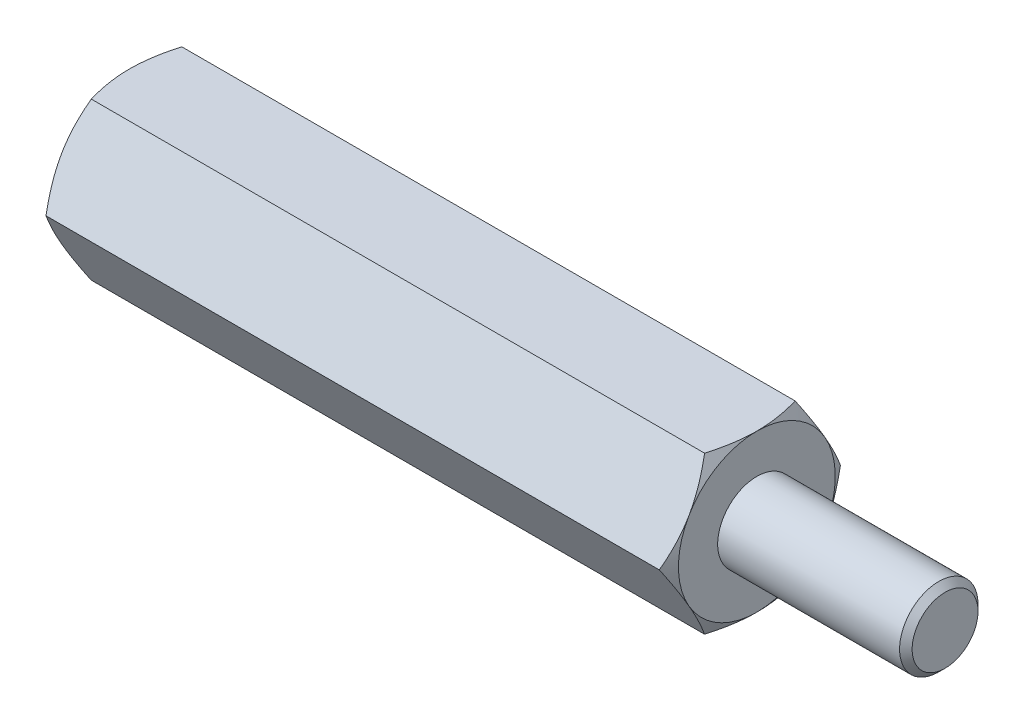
ISO-10303-21;
HEADER;
FILE_DESCRIPTION(('STEP AP214'),'2;1');
FILE_NAME('part.step','',(''),(''),'','','');
FILE_SCHEMA(('AUTOMOTIVE_DESIGN { 1 0 10303 214 1 1 1 1 }'));
ENDSEC;
DATA;
#1=APPLICATION_CONTEXT('core data for automotive mechanical design processes');
#2=APPLICATION_PROTOCOL_DEFINITION('international standard','automotive_design',2000,#1);
#3=PRODUCT_CONTEXT('',#1,'mechanical');
#4=PRODUCT('Part','Part','',(#3));
#5=PRODUCT_RELATED_PRODUCT_CATEGORY('part','',(#4));
#6=PRODUCT_DEFINITION_FORMATION('','',#4);
#7=PRODUCT_DEFINITION_CONTEXT('part definition',#1,'design');
#8=PRODUCT_DEFINITION('design','',#6,#7);
#9=PRODUCT_DEFINITION_SHAPE('','',#8);
#10=(LENGTH_UNIT() NAMED_UNIT(*) SI_UNIT(.MILLI.,.METRE.));
#11=(NAMED_UNIT(*) PLANE_ANGLE_UNIT() SI_UNIT($,.RADIAN.));
#12=(NAMED_UNIT(*) SI_UNIT($,.STERADIAN.) SOLID_ANGLE_UNIT());
#13=UNCERTAINTY_MEASURE_WITH_UNIT(LENGTH_MEASURE(1.E-05),#10,'distance_accuracy_value','');
#14=(GEOMETRIC_REPRESENTATION_CONTEXT(3) GLOBAL_UNCERTAINTY_ASSIGNED_CONTEXT((#13)) GLOBAL_UNIT_ASSIGNED_CONTEXT((#10,
#11,#12)) REPRESENTATION_CONTEXT('',''));
#15=CARTESIAN_POINT('',(0.,0.,0.));
#16=DIRECTION('',(0.,0.,1.));
#17=DIRECTION('',(1.,0.,0.));
#18=AXIS2_PLACEMENT_3D('',#15,#16,#17);
#19=CARTESIAN_POINT('',(10.,2.5,-1.44337567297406));
#20=DIRECTION('',(1.,0.,0.));
#21=DIRECTION('',(0.,0.,-1.));
#22=AXIS2_PLACEMENT_3D('',#19,#20,#21);
#23=PLANE('',#22);
#24=CARTESIAN_POINT('',(10.,0.,0.));
#25=DIRECTION('',(1.,0.,0.));
#26=DIRECTION('',(0.,0.,-1.));
#27=AXIS2_PLACEMENT_3D('',#24,#25,#26);
#28=CIRCLE('',#27,2.5);
#29=CARTESIAN_POINT('',(10.,-1.25,-2.1650635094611));
#30=VERTEX_POINT('',#29);
#31=CARTESIAN_POINT('',(10.,1.25,-2.1650635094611));
#32=VERTEX_POINT('',#31);
#33=EDGE_CURVE('E288',#30,#32,#28,.T.);
#34=ORIENTED_EDGE('',*,*,#33,.T.);
#35=CARTESIAN_POINT('',(10.,2.5,0.));
#36=VERTEX_POINT('',#35);
#37=EDGE_CURVE('E53',#32,#36,#28,.T.);
#38=ORIENTED_EDGE('',*,*,#37,.T.);
#39=CARTESIAN_POINT('',(10.,1.25,2.1650635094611));
#40=VERTEX_POINT('',#39);
#41=EDGE_CURVE('E296',#36,#40,#28,.T.);
#42=ORIENTED_EDGE('',*,*,#41,.T.);
#43=CARTESIAN_POINT('',(10.,-1.25,2.1650635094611));
#44=VERTEX_POINT('',#43);
#45=EDGE_CURVE('E302',#40,#44,#28,.T.);
#46=ORIENTED_EDGE('',*,*,#45,.T.);
#47=CARTESIAN_POINT('',(10.,0.,0.));
#48=DIRECTION('',(-1.,0.,0.));
#49=DIRECTION('',(0.,-1.,0.));
#50=AXIS2_PLACEMENT_3D('',#47,#48,#49);
#51=CIRCLE('',#50,2.5);
#52=CARTESIAN_POINT('',(10.,-2.5,0.));
#53=VERTEX_POINT('',#52);
#54=EDGE_CURVE('E193',#53,#44,#51,.T.);
#55=ORIENTED_EDGE('',*,*,#54,.F.);
#56=EDGE_CURVE('E61',#53,#30,#28,.T.);
#57=ORIENTED_EDGE('',*,*,#56,.T.);
#58=EDGE_LOOP('',(#34,#38,#42,#46,#55,#57));
#59=FACE_BOUND('',#58,.T.);
#60=CARTESIAN_POINT('',(10.,0.,0.));
#61=DIRECTION('',(1.,0.,0.));
#62=DIRECTION('',(0.,0.,-1.));
#63=AXIS2_PLACEMENT_3D('',#60,#61,#62);
#64=CIRCLE('',#63,1.25);
#65=CARTESIAN_POINT('',(10.,0.,-1.25));
#66=VERTEX_POINT('',#65);
#67=EDGE_CURVE('E322',#66,#66,#64,.T.);
#68=ORIENTED_EDGE('',*,*,#67,.F.);
#69=EDGE_LOOP('',(#68));
#70=FACE_BOUND('',#69,.T.);
#71=ADVANCED_FACE('F37',(#59,#70),#23,.T.);
#72=CARTESIAN_POINT('',(10.,0.,-2.88675134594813));
#73=DIRECTION('',(0.,-0.5,0.866025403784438));
#74=DIRECTION('',(0.,-0.866025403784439,-0.5));
#75=AXIS2_PLACEMENT_3D('',#72,#73,#74);
#76=PLANE('',#75);
#77=CARTESIAN_POINT('',(9.7766423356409,-0.00019999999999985,-2.88686681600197));
#78=CARTESIAN_POINT('',(9.81327837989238,0.109663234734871,-2.82343724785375));
#79=CARTESIAN_POINT('',(9.84659778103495,0.220474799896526,-2.75946016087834));
#80=CARTESIAN_POINT('',(9.90475771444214,0.444016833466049,-2.63039810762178));
#81=CARTESIAN_POINT('',(9.92957767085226,0.556751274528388,-2.5653108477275));
#82=CARTESIAN_POINT('',(9.96821434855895,0.780822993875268,-2.43594298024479));
#83=CARTESIAN_POINT('',(9.98228820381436,0.892125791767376,-2.37168227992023));
#84=CARTESIAN_POINT('',(9.99909084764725,1.11525522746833,-2.24285844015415));
#85=CARTESIAN_POINT('',(10.0018335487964,1.22708105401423,-2.17829576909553));
#86=CARTESIAN_POINT('',(9.99613423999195,1.43604197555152,-2.05765212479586));
#87=CARTESIAN_POINT('',(9.98909160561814,1.53320831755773,-2.0015531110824));
#88=CARTESIAN_POINT('',(9.96676858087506,1.726907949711,-1.88972057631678));
#89=CARTESIAN_POINT('',(9.95148056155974,1.82344056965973,-1.8339874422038));
#90=CARTESIAN_POINT('',(9.91326090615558,2.01753972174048,-1.7219242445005));
#91=CARTESIAN_POINT('',(9.89016722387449,2.11508168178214,-1.66560836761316));
#92=CARTESIAN_POINT('',(9.83775334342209,2.30871060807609,-1.55381665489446));
#93=CARTESIAN_POINT('',(9.80844546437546,2.40480005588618,-1.49833938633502));
#94=CARTESIAN_POINT('',(9.7766423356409,2.5002,-1.44326020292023));
#95=B_SPLINE_CURVE_WITH_KNOTS('',3,(#77,#78,#79,#80,#81,#82,#83,#84,#85,#86,#87,#88,#89,#90,#91,
#92,#93,#94),.UNSPECIFIED.,.F.,.F.,(4,2,2,2,2,2,2,2,4),(0.,0.396285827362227,0.79352433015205,
1.18093086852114,1.56786160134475,1.90479741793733,2.24204551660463,2.58677531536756,
2.93082800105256),.UNSPECIFIED.);
#96=CARTESIAN_POINT('',(9.7767090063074,0.,-2.88675134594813));
#97=VERTEX_POINT('',#96);
#98=EDGE_CURVE('E350',#97,#32,#95,.T.);
#99=ORIENTED_EDGE('',*,*,#98,.F.);
#100=DIRECTION('',(-1.,0.,0.));
#101=VECTOR('',#100,1.);
#102=CARTESIAN_POINT('',(10.,0.,-2.88675134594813));
#103=LINE('',#102,#101);
#104=CARTESIAN_POINT('',(-9.7767090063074,0.,-2.88675134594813));
#105=VERTEX_POINT('',#104);
#106=EDGE_CURVE('E264',#97,#105,#103,.T.);
#107=ORIENTED_EDGE('',*,*,#106,.T.);
#108=CARTESIAN_POINT('',(-9.7766423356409,2.5002,-1.44326020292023));
#109=CARTESIAN_POINT('',(-9.81327837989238,2.39033676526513,-1.50668977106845));
#110=CARTESIAN_POINT('',(-9.84659778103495,2.27952520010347,-1.57066685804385));
#111=CARTESIAN_POINT('',(-9.90475771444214,2.05598316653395,-1.69972891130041));
#112=CARTESIAN_POINT('',(-9.92957767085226,1.94324872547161,-1.7648161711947));
#113=CARTESIAN_POINT('',(-9.96821434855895,1.71917700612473,-1.8941840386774));
#114=CARTESIAN_POINT('',(-9.98228820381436,1.60787420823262,-1.95844473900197));
#115=CARTESIAN_POINT('',(-9.99909084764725,1.38474477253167,-2.08726857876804));
#116=CARTESIAN_POINT('',(-10.0018335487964,1.27291894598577,-2.15183124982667));
#117=CARTESIAN_POINT('',(-9.99613423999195,1.06395802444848,-2.27247489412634));
#118=CARTESIAN_POINT('',(-9.98909160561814,0.96679168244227,-2.32857390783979));
#119=CARTESIAN_POINT('',(-9.96676858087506,0.773092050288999,-2.44040644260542));
#120=CARTESIAN_POINT('',(-9.95148056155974,0.676559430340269,-2.49613957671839));
#121=CARTESIAN_POINT('',(-9.91326090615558,0.482460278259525,-2.60820277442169));
#122=CARTESIAN_POINT('',(-9.89016722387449,0.38491831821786,-2.66451865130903));
#123=CARTESIAN_POINT('',(-9.83775334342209,0.191289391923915,-2.77631036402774));
#124=CARTESIAN_POINT('',(-9.80844546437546,0.0951999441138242,-2.83178763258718));
#125=CARTESIAN_POINT('',(-9.7766423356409,-0.000199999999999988,-2.88686681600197));
#126=B_SPLINE_CURVE_WITH_KNOTS('',3,(#108,#109,#110,#111,#112,#113,#114,#115,#116,#117,#118,
#119,#120,#121,#122,#123,#124,#125),.UNSPECIFIED.,.F.,.F.,(4,2,2,2,2,2,2,2,4),(0.,
0.396285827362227,0.79352433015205,1.18093086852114,1.56786160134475,1.90479741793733,
2.24204551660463,2.58677531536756,2.93082800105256),.UNSPECIFIED.);
#127=CARTESIAN_POINT('',(-10.,1.25,-2.1650635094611));
#128=VERTEX_POINT('',#127);
#129=EDGE_CURVE('E340',#128,#105,#126,.T.);
#130=ORIENTED_EDGE('',*,*,#129,.F.);
#131=CARTESIAN_POINT('',(-9.7767090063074,2.5,-1.44337567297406));
#132=VERTEX_POINT('',#131);
#133=EDGE_CURVE('E405',#132,#128,#126,.T.);
#134=ORIENTED_EDGE('',*,*,#133,.F.);
#135=DIRECTION('',(-1.,0.,0.));
#136=VECTOR('',#135,1.);
#137=CARTESIAN_POINT('',(10.,2.5,-1.44337567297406));
#138=LINE('',#137,#136);
#139=CARTESIAN_POINT('',(9.77670900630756,2.5,-1.44337567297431));
#140=VERTEX_POINT('',#139);
#141=EDGE_CURVE('E279',#140,#132,#138,.T.);
#142=ORIENTED_EDGE('',*,*,#141,.F.);
#143=EDGE_CURVE('E229',#32,#140,#95,.T.);
#144=ORIENTED_EDGE('',*,*,#143,.F.);
#145=EDGE_LOOP('',(#99,#107,#130,#134,#142,#144));
#146=FACE_BOUND('',#145,.T.);
#147=ADVANCED_FACE('F148',(#146),#76,.F.);
#148=CARTESIAN_POINT('',(10.,2.5,-1.44337567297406));
#149=DIRECTION('',(0.,-1.,0.));
#150=DIRECTION('',(0.,0.,-1.));
#151=AXIS2_PLACEMENT_3D('',#148,#149,#150);
#152=PLANE('',#151);
#153=CARTESIAN_POINT('',(8.76803388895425,2.5,-3.90158441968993));
#154=CARTESIAN_POINT('',(8.82120772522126,2.5,-3.79217004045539));
#155=CARTESIAN_POINT('',(8.87387869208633,2.5,-3.68250707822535));
#156=CARTESIAN_POINT('',(8.97793249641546,2.5,-3.46255185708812));
#157=CARTESIAN_POINT('',(9.02931513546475,2.5,-3.35225950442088));
#158=CARTESIAN_POINT('',(9.13076309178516,2.5,-3.130356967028));
#159=CARTESIAN_POINT('',(9.18081992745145,2.5,-3.01874289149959));
#160=CARTESIAN_POINT('',(9.27891712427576,2.5,-2.79463535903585));
#161=CARTESIAN_POINT('',(9.32695757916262,2.5,-2.68214194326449));
#162=CARTESIAN_POINT('',(9.42201845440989,2.5,-2.45240385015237));
#163=CARTESIAN_POINT('',(9.46895431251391,2.5,-2.33512399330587));
#164=CARTESIAN_POINT('',(9.55933269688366,2.5,-2.09920133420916));
#165=CARTESIAN_POINT('',(9.60277483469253,2.5,-1.98055838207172));
#166=CARTESIAN_POINT('',(9.68504351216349,2.5,-1.74193489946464));
#167=CARTESIAN_POINT('',(9.72387917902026,2.5,-1.6219575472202));
#168=CARTESIAN_POINT('',(9.79570507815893,2.5,-1.38028205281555));
#169=CARTESIAN_POINT('',(9.82869712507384,2.5,-1.25858445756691));
#170=CARTESIAN_POINT('',(9.88709594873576,2.5,-1.01406369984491));
#171=CARTESIAN_POINT('',(9.91254379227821,2.5,-0.89125052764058));
#172=CARTESIAN_POINT('',(9.95442751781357,2.5,-0.644071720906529));
#173=CARTESIAN_POINT('',(9.97086432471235,2.5,-0.519706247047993));
#174=CARTESIAN_POINT('',(9.9932006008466,2.5,-0.271679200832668));
#175=CARTESIAN_POINT('',(9.99923751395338,2.5,-0.148030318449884));
#176=CARTESIAN_POINT('',(10.0006256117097,2.5,0.0993395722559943));
#177=CARTESIAN_POINT('',(9.99597656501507,2.5,0.223060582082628));
#178=CARTESIAN_POINT('',(9.97940443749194,2.5,0.432351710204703));
#179=CARTESIAN_POINT('',(9.97010665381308,2.5,0.518143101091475));
#180=CARTESIAN_POINT('',(9.94693847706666,2.5,0.689112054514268));
#181=CARTESIAN_POINT('',(9.93306748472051,2.5,0.77428953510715));
#182=CARTESIAN_POINT('',(9.88532020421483,2.5,1.02876599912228));
#183=CARTESIAN_POINT('',(9.84531764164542,2.5,1.19691958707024));
#184=CARTESIAN_POINT('',(9.75226567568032,2.5,1.53362893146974));
#185=CARTESIAN_POINT('',(9.69893620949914,2.5,1.70210423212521));
#186=CARTESIAN_POINT('',(9.61237169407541,2.5,1.95247339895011));
#187=CARTESIAN_POINT('',(9.58242477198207,2.5,2.03553184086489));
#188=CARTESIAN_POINT('',(9.52068409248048,2.5,2.20095860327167));
#189=CARTESIAN_POINT('',(9.48889037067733,2.5,2.2833269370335));
#190=CARTESIAN_POINT('',(9.40401426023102,2.5,2.49723312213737));
#191=CARTESIAN_POINT('',(9.34971733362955,2.5,2.6282879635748));
#192=CARTESIAN_POINT('',(9.2381273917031,2.5,2.88912034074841));
#193=CARTESIAN_POINT('',(9.1808341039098,2.5,3.01889775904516));
#194=CARTESIAN_POINT('',(9.06393487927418,2.5,3.27745045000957));
#195=CARTESIAN_POINT('',(9.00432825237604,2.5,3.40622540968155));
#196=CARTESIAN_POINT('',(8.8833234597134,2.5,3.66293235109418));
#197=CARTESIAN_POINT('',(8.82192524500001,2.5,3.79086430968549));
#198=CARTESIAN_POINT('',(8.63545801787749,2.5,4.17399495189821));
#199=CARTESIAN_POINT('',(8.50828249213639,2.5,4.42816724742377));
#200=CARTESIAN_POINT('',(8.25034557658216,2.5,4.93461464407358));
#201=CARTESIAN_POINT('',(8.11958483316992,2.5,5.18689007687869));
#202=CARTESIAN_POINT('',(7.86871001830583,2.5,5.66512451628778));
#203=CARTESIAN_POINT('',(7.74882986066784,2.5,5.89120644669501));
#204=CARTESIAN_POINT('',(7.50759021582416,2.5,6.34259369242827));
#205=CARTESIAN_POINT('',(7.38623065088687,2.5,6.56789896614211));
#206=CARTESIAN_POINT('',(7.14278038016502,2.5,7.01722044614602));
#207=CARTESIAN_POINT('',(7.02069305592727,2.5,7.24123848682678));
#208=CARTESIAN_POINT('',(6.77566624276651,2.5,7.68878772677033));
#209=CARTESIAN_POINT('',(6.65272681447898,2.5,7.9123189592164));
#210=CARTESIAN_POINT('',(6.52947566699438,2.5,8.13567697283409));
#211=B_SPLINE_CURVE_WITH_KNOTS('',3,(#153,#154,#155,#156,#157,#158,#159,#160,#161,#162,#163,
#164,#165,#166,#167,#168,#169,#170,#171,#172,#173,#174,#175,#176,#177,#178,#179,#180,#181,#182,
#183,#184,#185,#186,#187,#188,#189,#190,#191,#192,#193,#194,#195,#196,#197,#198,#199,#200,#201,
#202,#203,#204,#205,#206,#207,#208,#209,#210),.UNSPECIFIED.,.F.,.F.,(4,2,2,2,2,2,2,2,2,2,2,2,2,
2,2,2,2,2,2,2,2,2,2,2,2,2,2,2,4),(0.,0.364957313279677,0.729970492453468,1.09692930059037,
1.46387103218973,1.84279746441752,2.22176597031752,2.59997058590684,2.97805755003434,
3.35404692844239,3.72999770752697,4.10094071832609,4.47189175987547,4.73064905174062,
4.98944026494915,5.5072907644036,6.03710483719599,6.30196454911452,6.56681915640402,
6.99233818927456,7.41789598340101,7.84358170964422,8.26927907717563,9.12186602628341,
9.97430025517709,10.7419897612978,11.5097197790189,12.2750964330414,13.0404191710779),.UNSPECIFIED.);
#212=EDGE_CURVE('E227',#140,#36,#211,.T.);
#213=ORIENTED_EDGE('',*,*,#212,.F.);
#214=ORIENTED_EDGE('',*,*,#141,.T.);
#215=CARTESIAN_POINT('',(-8.76803388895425,2.5,-3.90158441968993));
#216=CARTESIAN_POINT('',(-8.82120772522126,2.5,-3.79217004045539));
#217=CARTESIAN_POINT('',(-8.87387869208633,2.5,-3.68250707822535));
#218=CARTESIAN_POINT('',(-8.97793249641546,2.5,-3.46255185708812));
#219=CARTESIAN_POINT('',(-9.02931513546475,2.5,-3.35225950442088));
#220=CARTESIAN_POINT('',(-9.13076309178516,2.5,-3.130356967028));
#221=CARTESIAN_POINT('',(-9.18081992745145,2.5,-3.01874289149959));
#222=CARTESIAN_POINT('',(-9.27891712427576,2.5,-2.79463535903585));
#223=CARTESIAN_POINT('',(-9.32695757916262,2.5,-2.68214194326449));
#224=CARTESIAN_POINT('',(-9.42201845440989,2.5,-2.45240385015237));
#225=CARTESIAN_POINT('',(-9.46895431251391,2.5,-2.33512399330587));
#226=CARTESIAN_POINT('',(-9.55933269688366,2.5,-2.09920133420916));
#227=CARTESIAN_POINT('',(-9.60277483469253,2.5,-1.98055838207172));
#228=CARTESIAN_POINT('',(-9.68504351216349,2.5,-1.74193489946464));
#229=CARTESIAN_POINT('',(-9.72387917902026,2.5,-1.6219575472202));
#230=CARTESIAN_POINT('',(-9.79570507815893,2.5,-1.38028205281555));
#231=CARTESIAN_POINT('',(-9.82869712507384,2.5,-1.25858445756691));
#232=CARTESIAN_POINT('',(-9.88709594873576,2.5,-1.01406369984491));
#233=CARTESIAN_POINT('',(-9.91254379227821,2.5,-0.89125052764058));
#234=CARTESIAN_POINT('',(-9.95442751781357,2.5,-0.644071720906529));
#235=CARTESIAN_POINT('',(-9.97086432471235,2.5,-0.519706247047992));
#236=CARTESIAN_POINT('',(-9.9932006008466,2.5,-0.271679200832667));
#237=CARTESIAN_POINT('',(-9.99923751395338,2.5,-0.148030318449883));
#238=CARTESIAN_POINT('',(-10.0006256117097,2.5,0.0993395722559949));
#239=CARTESIAN_POINT('',(-9.99597656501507,2.5,0.223060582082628));
#240=CARTESIAN_POINT('',(-9.97940443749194,2.5,0.432351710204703));
#241=CARTESIAN_POINT('',(-9.97010665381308,2.5,0.518143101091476));
#242=CARTESIAN_POINT('',(-9.94693847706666,2.5,0.689112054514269));
#243=CARTESIAN_POINT('',(-9.93306748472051,2.5,0.774289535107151));
#244=CARTESIAN_POINT('',(-9.88532020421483,2.5,1.02876599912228));
#245=CARTESIAN_POINT('',(-9.84531764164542,2.5,1.19691958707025));
#246=CARTESIAN_POINT('',(-9.75226567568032,2.5,1.53362893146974));
#247=CARTESIAN_POINT('',(-9.69893620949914,2.5,1.70210423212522));
#248=CARTESIAN_POINT('',(-9.61237169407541,2.5,1.95247339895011));
#249=CARTESIAN_POINT('',(-9.58242477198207,2.5,2.03553184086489));
#250=CARTESIAN_POINT('',(-9.52068409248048,2.5,2.20095860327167));
#251=CARTESIAN_POINT('',(-9.48889037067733,2.5,2.2833269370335));
#252=CARTESIAN_POINT('',(-9.40401426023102,2.5,2.49723312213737));
#253=CARTESIAN_POINT('',(-9.34971733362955,2.5,2.6282879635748));
#254=CARTESIAN_POINT('',(-9.2381273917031,2.5,2.88912034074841));
#255=CARTESIAN_POINT('',(-9.1808341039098,2.5,3.01889775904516));
#256=CARTESIAN_POINT('',(-9.06393487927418,2.5,3.27745045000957));
#257=CARTESIAN_POINT('',(-9.00432825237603,2.5,3.40622540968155));
#258=CARTESIAN_POINT('',(-8.8833234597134,2.5,3.66293235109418));
#259=CARTESIAN_POINT('',(-8.82192524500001,2.5,3.79086430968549));
#260=CARTESIAN_POINT('',(-8.6354580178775,2.5,4.17399495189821));
#261=CARTESIAN_POINT('',(-8.50828249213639,2.5,4.42816724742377));
#262=CARTESIAN_POINT('',(-8.25034557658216,2.5,4.93461464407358));
#263=CARTESIAN_POINT('',(-8.11958483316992,2.5,5.18689007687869));
#264=CARTESIAN_POINT('',(-7.86871001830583,2.5,5.66512451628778));
#265=CARTESIAN_POINT('',(-7.74882986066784,2.5,5.89120644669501));
#266=CARTESIAN_POINT('',(-7.50759021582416,2.5,6.34259369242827));
#267=CARTESIAN_POINT('',(-7.38623065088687,2.5,6.56789896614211));
#268=CARTESIAN_POINT('',(-7.14278038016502,2.5,7.01722044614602));
#269=CARTESIAN_POINT('',(-7.02069305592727,2.5,7.24123848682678));
#270=CARTESIAN_POINT('',(-6.77566624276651,2.5,7.68878772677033));
#271=CARTESIAN_POINT('',(-6.65272681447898,2.5,7.9123189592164));
#272=CARTESIAN_POINT('',(-6.52947566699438,2.5,8.13567697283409));
#273=B_SPLINE_CURVE_WITH_KNOTS('',3,(#215,#216,#217,#218,#219,#220,#221,#222,#223,#224,#225,
#226,#227,#228,#229,#230,#231,#232,#233,#234,#235,#236,#237,#238,#239,#240,#241,#242,#243,#244,
#245,#246,#247,#248,#249,#250,#251,#252,#253,#254,#255,#256,#257,#258,#259,#260,#261,#262,#263,
#264,#265,#266,#267,#268,#269,#270,#271,#272),.UNSPECIFIED.,.F.,.F.,(4,2,2,2,2,2,2,2,2,2,2,2,2,
2,2,2,2,2,2,2,2,2,2,2,2,2,2,2,4),(0.,0.364957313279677,0.729970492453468,1.09692930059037,
1.46387103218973,1.84279746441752,2.22176597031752,2.59997058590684,2.97805755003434,
3.35404692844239,3.72999770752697,4.10094071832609,4.47189175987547,4.73064905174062,
4.98944026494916,5.5072907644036,6.03710483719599,6.30196454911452,6.56681915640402,
6.99233818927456,7.41789598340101,7.84358170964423,8.26927907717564,9.12186602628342,
9.9743002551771,10.7419897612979,11.5097197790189,12.2750964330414,13.0404191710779),.UNSPECIFIED.);
#274=CARTESIAN_POINT('',(-10.,2.5,0.));
#275=VERTEX_POINT('',#274);
#276=EDGE_CURVE('E241',#275,#132,#273,.F.);
#277=ORIENTED_EDGE('',*,*,#276,.F.);
#278=CARTESIAN_POINT('',(-9.7767090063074,2.5,1.44337567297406));
#279=VERTEX_POINT('',#278);
#280=EDGE_CURVE('E249',#279,#275,#273,.F.);
#281=ORIENTED_EDGE('',*,*,#280,.F.);
#282=DIRECTION('',(-1.,0.,0.));
#283=VECTOR('',#282,1.);
#284=CARTESIAN_POINT('',(10.,2.5,1.44337567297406));
#285=LINE('',#284,#283);
#286=CARTESIAN_POINT('',(9.7767090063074,2.5,1.44337567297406));
#287=VERTEX_POINT('',#286);
#288=EDGE_CURVE('E276',#287,#279,#285,.T.);
#289=ORIENTED_EDGE('',*,*,#288,.F.);
#290=EDGE_CURVE('E221',#36,#287,#211,.T.);
#291=ORIENTED_EDGE('',*,*,#290,.F.);
#292=EDGE_LOOP('',(#213,#214,#277,#281,#289,#291));
#293=FACE_BOUND('',#292,.T.);
#294=ADVANCED_FACE('F153',(#293),#152,.F.);
#295=CARTESIAN_POINT('',(10.,2.5,1.44337567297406));
#296=DIRECTION('',(0.,-0.5,-0.866025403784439));
#297=DIRECTION('',(0.,0.866025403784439,-0.5));
#298=AXIS2_PLACEMENT_3D('',#295,#296,#297);
#299=PLANE('',#298);
#300=CARTESIAN_POINT('',(9.7766423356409,2.5002,1.44326020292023));
#301=CARTESIAN_POINT('',(9.81327837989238,2.39033676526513,1.50668977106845));
#302=CARTESIAN_POINT('',(9.84659778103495,2.27952520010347,1.57066685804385));
#303=CARTESIAN_POINT('',(9.90475771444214,2.05598316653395,1.69972891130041));
#304=CARTESIAN_POINT('',(9.92957767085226,1.94324872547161,1.7648161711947));
#305=CARTESIAN_POINT('',(9.96821434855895,1.71917700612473,1.8941840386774));
#306=CARTESIAN_POINT('',(9.98228820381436,1.60787420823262,1.95844473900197));
#307=CARTESIAN_POINT('',(9.99909084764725,1.38474477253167,2.08726857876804));
#308=CARTESIAN_POINT('',(10.0018335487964,1.27291894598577,2.15183124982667));
#309=CARTESIAN_POINT('',(9.99613423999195,1.06395802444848,2.27247489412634));
#310=CARTESIAN_POINT('',(9.98909160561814,0.96679168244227,2.32857390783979));
#311=CARTESIAN_POINT('',(9.96676858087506,0.773092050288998,2.44040644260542));
#312=CARTESIAN_POINT('',(9.95148056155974,0.676559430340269,2.49613957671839));
#313=CARTESIAN_POINT('',(9.91326090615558,0.482460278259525,2.60820277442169));
#314=CARTESIAN_POINT('',(9.89016722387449,0.38491831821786,2.66451865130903));
#315=CARTESIAN_POINT('',(9.83775334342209,0.191289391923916,2.77631036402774));
#316=CARTESIAN_POINT('',(9.80844546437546,0.0951999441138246,2.83178763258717));
#317=CARTESIAN_POINT('',(9.7766423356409,-0.000199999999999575,2.88686681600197));
#318=B_SPLINE_CURVE_WITH_KNOTS('',3,(#300,#301,#302,#303,#304,#305,#306,#307,#308,#309,#310,
#311,#312,#313,#314,#315,#316,#317),.UNSPECIFIED.,.F.,.F.,(4,2,2,2,2,2,2,2,4),(0.,
0.396285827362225,0.79352433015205,1.18093086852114,1.56786160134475,1.90479741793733,
2.24204551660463,2.58677531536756,2.93082800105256),.UNSPECIFIED.);
#319=EDGE_CURVE('E228',#287,#40,#318,.T.);
#320=ORIENTED_EDGE('',*,*,#319,.F.);
#321=ORIENTED_EDGE('',*,*,#288,.T.);
#322=CARTESIAN_POINT('',(-9.7766423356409,-0.000199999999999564,2.88686681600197));
#323=CARTESIAN_POINT('',(-9.81327837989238,0.109663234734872,2.82343724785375));
#324=CARTESIAN_POINT('',(-9.84659778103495,0.220474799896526,2.75946016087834));
#325=CARTESIAN_POINT('',(-9.90475771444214,0.444016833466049,2.63039810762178));
#326=CARTESIAN_POINT('',(-9.92957767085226,0.556751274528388,2.5653108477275));
#327=CARTESIAN_POINT('',(-9.96821434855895,0.780822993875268,2.43594298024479));
#328=CARTESIAN_POINT('',(-9.98228820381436,0.892125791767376,2.37168227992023));
#329=CARTESIAN_POINT('',(-9.99909084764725,1.11525522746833,2.24285844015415));
#330=CARTESIAN_POINT('',(-10.0018335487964,1.22708105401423,2.17829576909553));
#331=CARTESIAN_POINT('',(-9.99613423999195,1.43604197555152,2.05765212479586));
#332=CARTESIAN_POINT('',(-9.98909160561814,1.53320831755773,2.0015531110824));
#333=CARTESIAN_POINT('',(-9.96676858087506,1.726907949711,1.88972057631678));
#334=CARTESIAN_POINT('',(-9.95148056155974,1.82344056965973,1.8339874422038));
#335=CARTESIAN_POINT('',(-9.91326090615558,2.01753972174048,1.7219242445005));
#336=CARTESIAN_POINT('',(-9.89016722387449,2.11508168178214,1.66560836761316));
#337=CARTESIAN_POINT('',(-9.83775334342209,2.30871060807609,1.55381665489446));
#338=CARTESIAN_POINT('',(-9.80844546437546,2.40480005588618,1.49833938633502));
#339=CARTESIAN_POINT('',(-9.7766423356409,2.5002,1.44326020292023));
#340=B_SPLINE_CURVE_WITH_KNOTS('',3,(#322,#323,#324,#325,#326,#327,#328,#329,#330,#331,#332,
#333,#334,#335,#336,#337,#338,#339),.UNSPECIFIED.,.F.,.F.,(4,2,2,2,2,2,2,2,4),(0.,
0.396285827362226,0.793524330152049,1.18093086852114,1.56786160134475,1.90479741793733,
2.24204551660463,2.58677531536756,2.93082800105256),.UNSPECIFIED.);
#341=CARTESIAN_POINT('',(-10.,1.25,2.1650635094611));
#342=VERTEX_POINT('',#341);
#343=EDGE_CURVE('E255',#342,#279,#340,.T.);
#344=ORIENTED_EDGE('',*,*,#343,.F.);
#345=CARTESIAN_POINT('',(-9.7767090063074,0.,2.88675134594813));
#346=VERTEX_POINT('',#345);
#347=EDGE_CURVE('E262',#346,#342,#340,.T.);
#348=ORIENTED_EDGE('',*,*,#347,.F.);
#349=DIRECTION('',(-1.,0.,0.));
#350=VECTOR('',#349,1.);
#351=CARTESIAN_POINT('',(10.,0.,2.88675134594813));
#352=LINE('',#351,#350);
#353=CARTESIAN_POINT('',(9.7767090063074,0.,2.88675134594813));
#354=VERTEX_POINT('',#353);
#355=EDGE_CURVE('E273',#354,#346,#352,.T.);
#356=ORIENTED_EDGE('',*,*,#355,.F.);
#357=EDGE_CURVE('E215',#40,#354,#318,.T.);
#358=ORIENTED_EDGE('',*,*,#357,.F.);
#359=EDGE_LOOP('',(#320,#321,#344,#348,#356,#358));
#360=FACE_BOUND('',#359,.T.);
#361=ADVANCED_FACE('F235',(#360),#299,.F.);
#362=CARTESIAN_POINT('',(10.,0.,2.88675134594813));
#363=DIRECTION('',(0.,0.5,-0.866025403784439));
#364=DIRECTION('',(0.,0.866025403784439,0.5));
#365=AXIS2_PLACEMENT_3D('',#362,#363,#364);
#366=PLANE('',#365);
#367=CARTESIAN_POINT('',(9.7766423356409,0.000200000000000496,2.88686681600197));
#368=CARTESIAN_POINT('',(9.81327837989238,-0.10966323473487,2.82343724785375));
#369=CARTESIAN_POINT('',(9.84659778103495,-0.220474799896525,2.75946016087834));
#370=CARTESIAN_POINT('',(9.90475771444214,-0.444016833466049,2.63039810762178));
#371=CARTESIAN_POINT('',(9.92957767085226,-0.556751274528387,2.5653108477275));
#372=CARTESIAN_POINT('',(9.96821434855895,-0.780822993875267,2.43594298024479));
#373=CARTESIAN_POINT('',(9.98228820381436,-0.892125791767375,2.37168227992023));
#374=CARTESIAN_POINT('',(9.99909084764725,-1.11525522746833,2.24285844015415));
#375=CARTESIAN_POINT('',(10.0018335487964,-1.22708105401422,2.17829576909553));
#376=CARTESIAN_POINT('',(9.99613423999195,-1.43604197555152,2.05765212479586));
#377=CARTESIAN_POINT('',(9.98909160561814,-1.53320831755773,2.0015531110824));
#378=CARTESIAN_POINT('',(9.96676858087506,-1.726907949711,1.88972057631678));
#379=CARTESIAN_POINT('',(9.95148056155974,-1.82344056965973,1.8339874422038));
#380=CARTESIAN_POINT('',(9.91326090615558,-2.01753972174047,1.7219242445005));
#381=CARTESIAN_POINT('',(9.89016722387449,-2.11508168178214,1.66560836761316));
#382=CARTESIAN_POINT('',(9.83775334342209,-2.30871060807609,1.55381665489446));
#383=CARTESIAN_POINT('',(9.80844546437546,-2.40480005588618,1.49833938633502));
#384=CARTESIAN_POINT('',(9.7766423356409,-2.5002,1.44326020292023));
#385=B_SPLINE_CURVE_WITH_KNOTS('',3,(#367,#368,#369,#370,#371,#372,#373,#374,#375,#376,#377,
#378,#379,#380,#381,#382,#383,#384),.UNSPECIFIED.,.F.,.F.,(4,2,2,2,2,2,2,2,4),(0.,
0.396285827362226,0.79352433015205,1.18093086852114,1.56786160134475,1.90479741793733,
2.24204551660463,2.58677531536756,2.93082800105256),.UNSPECIFIED.);
#386=EDGE_CURVE('E330',#354,#44,#385,.T.);
#387=ORIENTED_EDGE('',*,*,#386,.F.);
#388=ORIENTED_EDGE('',*,*,#355,.T.);
#389=CARTESIAN_POINT('',(-9.7766423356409,-2.5002,1.44326020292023));
#390=CARTESIAN_POINT('',(-9.81327837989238,-2.39033676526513,1.50668977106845));
#391=CARTESIAN_POINT('',(-9.84659778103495,-2.27952520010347,1.57066685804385));
#392=CARTESIAN_POINT('',(-9.90475771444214,-2.05598316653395,1.69972891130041));
#393=CARTESIAN_POINT('',(-9.92957767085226,-1.94324872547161,1.7648161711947));
#394=CARTESIAN_POINT('',(-9.96821434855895,-1.71917700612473,1.8941840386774));
#395=CARTESIAN_POINT('',(-9.98228820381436,-1.60787420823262,1.95844473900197));
#396=CARTESIAN_POINT('',(-9.99909084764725,-1.38474477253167,2.08726857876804));
#397=CARTESIAN_POINT('',(-10.0018335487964,-1.27291894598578,2.15183124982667));
#398=CARTESIAN_POINT('',(-9.99613423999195,-1.06395802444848,2.27247489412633));
#399=CARTESIAN_POINT('',(-9.98909160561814,-0.966791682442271,2.32857390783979));
#400=CARTESIAN_POINT('',(-9.96676858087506,-0.773092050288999,2.44040644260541));
#401=CARTESIAN_POINT('',(-9.95148056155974,-0.676559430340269,2.49613957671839));
#402=CARTESIAN_POINT('',(-9.91326090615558,-0.482460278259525,2.60820277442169));
#403=CARTESIAN_POINT('',(-9.89016722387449,-0.38491831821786,2.66451865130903));
#404=CARTESIAN_POINT('',(-9.83775334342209,-0.191289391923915,2.77631036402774));
#405=CARTESIAN_POINT('',(-9.80844546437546,-0.0951999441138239,2.83178763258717));
#406=CARTESIAN_POINT('',(-9.7766423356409,0.000200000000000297,2.88686681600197));
#407=B_SPLINE_CURVE_WITH_KNOTS('',3,(#389,#390,#391,#392,#393,#394,#395,#396,#397,#398,#399,
#400,#401,#402,#403,#404,#405,#406),.UNSPECIFIED.,.F.,.F.,(4,2,2,2,2,2,2,2,4),(0.,
0.396285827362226,0.793524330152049,1.18093086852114,1.56786160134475,1.90479741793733,
2.24204551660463,2.58677531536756,2.93082800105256),.UNSPECIFIED.);
#408=CARTESIAN_POINT('',(-10.,-1.25,2.1650635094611));
#409=VERTEX_POINT('',#408);
#410=EDGE_CURVE('E263',#409,#346,#407,.T.);
#411=ORIENTED_EDGE('',*,*,#410,.F.);
#412=CARTESIAN_POINT('',(-9.7767090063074,-2.5,1.44337567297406));
#413=VERTEX_POINT('',#412);
#414=EDGE_CURVE('E250',#413,#409,#407,.T.);
#415=ORIENTED_EDGE('',*,*,#414,.F.);
#416=DIRECTION('',(-1.,0.,0.));
#417=VECTOR('',#416,1.);
#418=CARTESIAN_POINT('',(10.,-2.5,1.44337567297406));
#419=LINE('',#418,#417);
#420=CARTESIAN_POINT('',(9.7767090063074,-2.5,1.44337567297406));
#421=VERTEX_POINT('',#420);
#422=EDGE_CURVE('E270',#421,#413,#419,.T.);
#423=ORIENTED_EDGE('',*,*,#422,.F.);
#424=EDGE_CURVE('E210',#44,#421,#385,.T.);
#425=ORIENTED_EDGE('',*,*,#424,.F.);
#426=EDGE_LOOP('',(#387,#388,#411,#415,#423,#425));
#427=FACE_BOUND('',#426,.T.);
#428=ADVANCED_FACE('F375',(#427),#366,.F.);
#429=CARTESIAN_POINT('',(10.,-2.5,1.44337567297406));
#430=DIRECTION('',(0.,1.,0.));
#431=DIRECTION('',(0.,0.,1.));
#432=AXIS2_PLACEMENT_3D('',#429,#430,#431);
#433=PLANE('',#432);
#434=CARTESIAN_POINT('',(8.76803388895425,-2.5,-3.90158441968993));
#435=CARTESIAN_POINT('',(8.82120772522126,-2.5,-3.79217004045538));
#436=CARTESIAN_POINT('',(8.87387869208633,-2.5,-3.68250707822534));
#437=CARTESIAN_POINT('',(8.97793249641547,-2.5,-3.46255185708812));
#438=CARTESIAN_POINT('',(9.02931513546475,-2.5,-3.35225950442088));
#439=CARTESIAN_POINT('',(9.13076309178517,-2.5,-3.130356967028));
#440=CARTESIAN_POINT('',(9.18081992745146,-2.5,-3.01874289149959));
#441=CARTESIAN_POINT('',(9.27891712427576,-2.5,-2.79463535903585));
#442=CARTESIAN_POINT('',(9.32695757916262,-2.5,-2.68214194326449));
#443=CARTESIAN_POINT('',(9.42201845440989,-2.5,-2.45240385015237));
#444=CARTESIAN_POINT('',(9.46895431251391,-2.5,-2.33512399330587));
#445=CARTESIAN_POINT('',(9.55933269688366,-2.5,-2.09920133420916));
#446=CARTESIAN_POINT('',(9.60277483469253,-2.5,-1.98055838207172));
#447=CARTESIAN_POINT('',(9.68504351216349,-2.5,-1.74193489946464));
#448=CARTESIAN_POINT('',(9.72387917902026,-2.5,-1.6219575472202));
#449=CARTESIAN_POINT('',(9.79570507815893,-2.5,-1.38028205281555));
#450=CARTESIAN_POINT('',(9.82869712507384,-2.5,-1.25858445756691));
#451=CARTESIAN_POINT('',(9.88709594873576,-2.5,-1.01406369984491));
#452=CARTESIAN_POINT('',(9.91254379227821,-2.5,-0.891250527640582));
#453=CARTESIAN_POINT('',(9.95442751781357,-2.5,-0.644071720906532));
#454=CARTESIAN_POINT('',(9.97086432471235,-2.5,-0.519706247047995));
#455=CARTESIAN_POINT('',(9.9932006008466,-2.5,-0.27167920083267));
#456=CARTESIAN_POINT('',(9.99923751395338,-2.5,-0.148030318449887));
#457=CARTESIAN_POINT('',(10.0006256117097,-2.5,0.0993395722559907));
#458=CARTESIAN_POINT('',(9.99597656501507,-2.5,0.223060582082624));
#459=CARTESIAN_POINT('',(9.97940443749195,-2.5,0.432351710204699));
#460=CARTESIAN_POINT('',(9.97010665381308,-2.5,0.518143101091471));
#461=CARTESIAN_POINT('',(9.94693847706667,-2.5,0.689112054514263));
#462=CARTESIAN_POINT('',(9.93306748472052,-2.5,0.774289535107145));
#463=CARTESIAN_POINT('',(9.88532020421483,-2.5,1.02876599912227));
#464=CARTESIAN_POINT('',(9.84531764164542,-2.5,1.19691958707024));
#465=CARTESIAN_POINT('',(9.75226567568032,-2.5,1.53362893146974));
#466=CARTESIAN_POINT('',(9.69893620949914,-2.5,1.70210423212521));
#467=CARTESIAN_POINT('',(9.61237169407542,-2.5,1.9524733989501));
#468=CARTESIAN_POINT('',(9.58242477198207,-2.5,2.03553184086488));
#469=CARTESIAN_POINT('',(9.52068409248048,-2.5,2.20095860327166));
#470=CARTESIAN_POINT('',(9.48889037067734,-2.5,2.28332693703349));
#471=CARTESIAN_POINT('',(9.40401426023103,-2.5,2.49723312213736));
#472=CARTESIAN_POINT('',(9.34971733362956,-2.5,2.62828796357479));
#473=CARTESIAN_POINT('',(9.2381273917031,-2.5,2.8891203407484));
#474=CARTESIAN_POINT('',(9.18083410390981,-2.5,3.01889775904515));
#475=CARTESIAN_POINT('',(9.06393487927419,-2.5,3.27745045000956));
#476=CARTESIAN_POINT('',(9.00432825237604,-2.5,3.40622540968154));
#477=CARTESIAN_POINT('',(8.8833234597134,-2.5,3.66293235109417));
#478=CARTESIAN_POINT('',(8.82192524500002,-2.5,3.79086430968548));
#479=CARTESIAN_POINT('',(8.6354580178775,-2.5,4.1739949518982));
#480=CARTESIAN_POINT('',(8.50828249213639,-2.5,4.42816724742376));
#481=CARTESIAN_POINT('',(8.25034557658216,-2.5,4.93461464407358));
#482=CARTESIAN_POINT('',(8.11958483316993,-2.5,5.18689007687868));
#483=CARTESIAN_POINT('',(7.86871001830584,-2.5,5.66512451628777));
#484=CARTESIAN_POINT('',(7.74882986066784,-2.5,5.891206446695));
#485=CARTESIAN_POINT('',(7.50759021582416,-2.5,6.34259369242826));
#486=CARTESIAN_POINT('',(7.38623065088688,-2.5,6.5678989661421));
#487=CARTESIAN_POINT('',(7.14278038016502,-2.5,7.01722044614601));
#488=CARTESIAN_POINT('',(7.02069305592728,-2.5,7.24123848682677));
#489=CARTESIAN_POINT('',(6.77566624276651,-2.5,7.68878772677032));
#490=CARTESIAN_POINT('',(6.65272681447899,-2.5,7.91231895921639));
#491=CARTESIAN_POINT('',(6.52947566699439,-2.5,8.13567697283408));
#492=B_SPLINE_CURVE_WITH_KNOTS('',3,(#434,#435,#436,#437,#438,#439,#440,#441,#442,#443,#444,
#445,#446,#447,#448,#449,#450,#451,#452,#453,#454,#455,#456,#457,#458,#459,#460,#461,#462,#463,
#464,#465,#466,#467,#468,#469,#470,#471,#472,#473,#474,#475,#476,#477,#478,#479,#480,#481,#482,
#483,#484,#485,#486,#487,#488,#489,#490,#491),.UNSPECIFIED.,.F.,.F.,(4,2,2,2,2,2,2,2,2,2,2,2,2,
2,2,2,2,2,2,2,2,2,2,2,2,2,2,2,4),(0.,0.364957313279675,0.729970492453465,1.09692930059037,
1.46387103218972,1.84279746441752,2.22176597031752,2.59997058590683,2.97805755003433,
3.35404692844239,3.72999770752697,4.10094071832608,4.47189175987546,4.73064905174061,
4.98944026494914,5.50729076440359,6.03710483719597,6.30196454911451,6.566819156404,
6.99233818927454,7.41789598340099,7.84358170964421,8.26927907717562,9.1218660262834,
9.97430025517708,10.7419897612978,11.5097197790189,12.2750964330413,13.0404191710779),.UNSPECIFIED.);
#493=EDGE_CURVE('E384',#421,#53,#492,.F.);
#494=ORIENTED_EDGE('',*,*,#493,.F.);
#495=ORIENTED_EDGE('',*,*,#422,.T.);
#496=CARTESIAN_POINT('',(-8.76803388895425,-2.5,-3.90158441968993));
#497=CARTESIAN_POINT('',(-8.82120772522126,-2.5,-3.79217004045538));
#498=CARTESIAN_POINT('',(-8.87387869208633,-2.5,-3.68250707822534));
#499=CARTESIAN_POINT('',(-8.97793249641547,-2.5,-3.46255185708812));
#500=CARTESIAN_POINT('',(-9.02931513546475,-2.5,-3.35225950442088));
#501=CARTESIAN_POINT('',(-9.13076309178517,-2.5,-3.130356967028));
#502=CARTESIAN_POINT('',(-9.18081992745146,-2.5,-3.01874289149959));
#503=CARTESIAN_POINT('',(-9.27891712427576,-2.5,-2.79463535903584));
#504=CARTESIAN_POINT('',(-9.32695757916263,-2.5,-2.68214194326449));
#505=CARTESIAN_POINT('',(-9.42201845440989,-2.5,-2.45240385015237));
#506=CARTESIAN_POINT('',(-9.46895431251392,-2.5,-2.33512399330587));
#507=CARTESIAN_POINT('',(-9.55933269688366,-2.5,-2.09920133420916));
#508=CARTESIAN_POINT('',(-9.60277483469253,-2.5,-1.98055838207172));
#509=CARTESIAN_POINT('',(-9.68504351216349,-2.5,-1.74193489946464));
#510=CARTESIAN_POINT('',(-9.72387917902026,-2.5,-1.6219575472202));
#511=CARTESIAN_POINT('',(-9.79570507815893,-2.5,-1.38028205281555));
#512=CARTESIAN_POINT('',(-9.82869712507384,-2.5,-1.25858445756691));
#513=CARTESIAN_POINT('',(-9.88709594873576,-2.5,-1.01406369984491));
#514=CARTESIAN_POINT('',(-9.91254379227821,-2.5,-0.891250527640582));
#515=CARTESIAN_POINT('',(-9.95442751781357,-2.5,-0.644071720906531));
#516=CARTESIAN_POINT('',(-9.97086432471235,-2.5,-0.519706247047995));
#517=CARTESIAN_POINT('',(-9.9932006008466,-2.5,-0.27167920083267));
#518=CARTESIAN_POINT('',(-9.99923751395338,-2.5,-0.148030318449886));
#519=CARTESIAN_POINT('',(-10.0006256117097,-2.5,0.0993395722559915));
#520=CARTESIAN_POINT('',(-9.99597656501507,-2.5,0.223060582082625));
#521=CARTESIAN_POINT('',(-9.97940443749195,-2.5,0.432351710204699));
#522=CARTESIAN_POINT('',(-9.97010665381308,-2.5,0.518143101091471));
#523=CARTESIAN_POINT('',(-9.94693847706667,-2.5,0.689112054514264));
#524=CARTESIAN_POINT('',(-9.93306748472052,-2.5,0.774289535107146));
#525=CARTESIAN_POINT('',(-9.88532020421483,-2.5,1.02876599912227));
#526=CARTESIAN_POINT('',(-9.84531764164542,-2.5,1.19691958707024));
#527=CARTESIAN_POINT('',(-9.75226567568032,-2.5,1.53362893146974));
#528=CARTESIAN_POINT('',(-9.69893620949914,-2.5,1.70210423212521));
#529=CARTESIAN_POINT('',(-9.61237169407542,-2.5,1.95247339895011));
#530=CARTESIAN_POINT('',(-9.58242477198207,-2.5,2.03553184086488));
#531=CARTESIAN_POINT('',(-9.52068409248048,-2.5,2.20095860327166));
#532=CARTESIAN_POINT('',(-9.48889037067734,-2.5,2.28332693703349));
#533=CARTESIAN_POINT('',(-9.40401426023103,-2.5,2.49723312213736));
#534=CARTESIAN_POINT('',(-9.34971733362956,-2.5,2.62828796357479));
#535=CARTESIAN_POINT('',(-9.2381273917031,-2.5,2.8891203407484));
#536=CARTESIAN_POINT('',(-9.18083410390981,-2.5,3.01889775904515));
#537=CARTESIAN_POINT('',(-9.06393487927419,-2.5,3.27745045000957));
#538=CARTESIAN_POINT('',(-9.00432825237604,-2.5,3.40622540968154));
#539=CARTESIAN_POINT('',(-8.8833234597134,-2.5,3.66293235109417));
#540=CARTESIAN_POINT('',(-8.82192524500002,-2.5,3.79086430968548));
#541=CARTESIAN_POINT('',(-8.6354580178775,-2.5,4.1739949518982));
#542=CARTESIAN_POINT('',(-8.50828249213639,-2.5,4.42816724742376));
#543=CARTESIAN_POINT('',(-8.25034557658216,-2.5,4.93461464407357));
#544=CARTESIAN_POINT('',(-8.11958483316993,-2.5,5.18689007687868));
#545=CARTESIAN_POINT('',(-7.86871001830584,-2.5,5.66512451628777));
#546=CARTESIAN_POINT('',(-7.74882986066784,-2.5,5.891206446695));
#547=CARTESIAN_POINT('',(-7.50759021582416,-2.5,6.34259369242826));
#548=CARTESIAN_POINT('',(-7.38623065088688,-2.5,6.5678989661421));
#549=CARTESIAN_POINT('',(-7.14278038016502,-2.5,7.01722044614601));
#550=CARTESIAN_POINT('',(-7.02069305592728,-2.5,7.24123848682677));
#551=CARTESIAN_POINT('',(-6.77566624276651,-2.5,7.68878772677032));
#552=CARTESIAN_POINT('',(-6.65272681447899,-2.5,7.91231895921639));
#553=CARTESIAN_POINT('',(-6.52947566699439,-2.5,8.13567697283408));
#554=B_SPLINE_CURVE_WITH_KNOTS('',3,(#496,#497,#498,#499,#500,#501,#502,#503,#504,#505,#506,
#507,#508,#509,#510,#511,#512,#513,#514,#515,#516,#517,#518,#519,#520,#521,#522,#523,#524,#525,
#526,#527,#528,#529,#530,#531,#532,#533,#534,#535,#536,#537,#538,#539,#540,#541,#542,#543,#544,
#545,#546,#547,#548,#549,#550,#551,#552,#553),.UNSPECIFIED.,.F.,.F.,(4,2,2,2,2,2,2,2,2,2,2,2,2,
2,2,2,2,2,2,2,2,2,2,2,2,2,2,2,4),(0.,0.364957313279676,0.729970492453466,1.09692930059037,
1.46387103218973,1.84279746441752,2.22176597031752,2.59997058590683,2.97805755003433,
3.35404692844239,3.72999770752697,4.10094071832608,4.47189175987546,4.73064905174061,
4.98944026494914,5.50729076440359,6.03710483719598,6.30196454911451,6.56681915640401,
6.99233818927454,7.417895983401,7.84358170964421,8.26927907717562,9.1218660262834,
9.97430025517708,10.7419897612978,11.5097197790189,12.2750964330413,13.0404191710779),.UNSPECIFIED.);
#555=CARTESIAN_POINT('',(-10.,-2.5,0.));
#556=VERTEX_POINT('',#555);
#557=EDGE_CURVE('E341',#556,#413,#554,.T.);
#558=ORIENTED_EDGE('',*,*,#557,.F.);
#559=CARTESIAN_POINT('',(-9.7767090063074,-2.5,-1.44337567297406));
#560=VERTEX_POINT('',#559);
#561=EDGE_CURVE('E334',#560,#556,#554,.T.);
#562=ORIENTED_EDGE('',*,*,#561,.F.);
#563=DIRECTION('',(-1.,0.,0.));
#564=VECTOR('',#563,1.);
#565=CARTESIAN_POINT('',(10.,-2.5,-1.44337567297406));
#566=LINE('',#565,#564);
#567=CARTESIAN_POINT('',(9.7767090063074,-2.5,-1.44337567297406));
#568=VERTEX_POINT('',#567);
#569=EDGE_CURVE('E267',#568,#560,#566,.T.);
#570=ORIENTED_EDGE('',*,*,#569,.F.);
#571=EDGE_CURVE('E195',#53,#568,#492,.F.);
#572=ORIENTED_EDGE('',*,*,#571,.F.);
#573=EDGE_LOOP('',(#494,#495,#558,#562,#570,#572));
#574=FACE_BOUND('',#573,.T.);
#575=ADVANCED_FACE('F172',(#574),#433,.F.);
#576=CARTESIAN_POINT('',(10.,-2.5,-1.44337567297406));
#577=DIRECTION('',(0.,0.5,0.866025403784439));
#578=DIRECTION('',(0.,-0.866025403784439,0.5));
#579=AXIS2_PLACEMENT_3D('',#576,#577,#578);
#580=PLANE('',#579);
#581=CARTESIAN_POINT('',(9.7766423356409,-2.5002,-1.44326020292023));
#582=CARTESIAN_POINT('',(9.81327837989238,-2.39033676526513,-1.50668977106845));
#583=CARTESIAN_POINT('',(9.84659778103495,-2.27952520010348,-1.57066685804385));
#584=CARTESIAN_POINT('',(9.90475771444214,-2.05598316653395,-1.69972891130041));
#585=CARTESIAN_POINT('',(9.92957767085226,-1.94324872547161,-1.7648161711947));
#586=CARTESIAN_POINT('',(9.96821434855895,-1.71917700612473,-1.8941840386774));
#587=CARTESIAN_POINT('',(9.98228820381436,-1.60787420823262,-1.95844473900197));
#588=CARTESIAN_POINT('',(9.99909084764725,-1.38474477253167,-2.08726857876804));
#589=CARTESIAN_POINT('',(10.0018335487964,-1.27291894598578,-2.15183124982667));
#590=CARTESIAN_POINT('',(9.99613423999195,-1.06395802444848,-2.27247489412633));
#591=CARTESIAN_POINT('',(9.98909160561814,-0.966791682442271,-2.32857390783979));
#592=CARTESIAN_POINT('',(9.96676858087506,-0.773092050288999,-2.44040644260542));
#593=CARTESIAN_POINT('',(9.95148056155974,-0.676559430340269,-2.49613957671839));
#594=CARTESIAN_POINT('',(9.91326090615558,-0.482460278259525,-2.60820277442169));
#595=CARTESIAN_POINT('',(9.89016722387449,-0.38491831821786,-2.66451865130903));
#596=CARTESIAN_POINT('',(9.83775334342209,-0.191289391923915,-2.77631036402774));
#597=CARTESIAN_POINT('',(9.80844546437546,-0.095199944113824,-2.83178763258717));
#598=CARTESIAN_POINT('',(9.7766423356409,0.000200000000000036,-2.88686681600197));
#599=B_SPLINE_CURVE_WITH_KNOTS('',3,(#581,#582,#583,#584,#585,#586,#587,#588,#589,#590,#591,
#592,#593,#594,#595,#596,#597,#598),.UNSPECIFIED.,.F.,.F.,(4,2,2,2,2,2,2,2,4),(0.,
0.396285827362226,0.793524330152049,1.18093086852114,1.56786160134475,1.90479741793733,
2.24204551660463,2.58677531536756,2.93082800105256),.UNSPECIFIED.);
#600=EDGE_CURVE('E192',#568,#30,#599,.T.);
#601=ORIENTED_EDGE('',*,*,#600,.F.);
#602=ORIENTED_EDGE('',*,*,#569,.T.);
#603=CARTESIAN_POINT('',(-9.7766423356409,0.000200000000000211,-2.88686681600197));
#604=CARTESIAN_POINT('',(-9.81327837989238,-0.109663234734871,-2.82343724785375));
#605=CARTESIAN_POINT('',(-9.84659778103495,-0.220474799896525,-2.75946016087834));
#606=CARTESIAN_POINT('',(-9.90475771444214,-0.444016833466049,-2.63039810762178));
#607=CARTESIAN_POINT('',(-9.92957767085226,-0.556751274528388,-2.5653108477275));
#608=CARTESIAN_POINT('',(-9.96821434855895,-0.780822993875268,-2.43594298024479));
#609=CARTESIAN_POINT('',(-9.98228820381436,-0.892125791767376,-2.37168227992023));
#610=CARTESIAN_POINT('',(-9.99909084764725,-1.11525522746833,-2.24285844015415));
#611=CARTESIAN_POINT('',(-10.0018335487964,-1.22708105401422,-2.17829576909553));
#612=CARTESIAN_POINT('',(-9.99613423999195,-1.43604197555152,-2.05765212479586));
#613=CARTESIAN_POINT('',(-9.98909160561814,-1.53320831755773,-2.0015531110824));
#614=CARTESIAN_POINT('',(-9.96676858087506,-1.726907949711,-1.88972057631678));
#615=CARTESIAN_POINT('',(-9.95148056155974,-1.82344056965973,-1.8339874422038));
#616=CARTESIAN_POINT('',(-9.91326090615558,-2.01753972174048,-1.7219242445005));
#617=CARTESIAN_POINT('',(-9.89016722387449,-2.11508168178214,-1.66560836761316));
#618=CARTESIAN_POINT('',(-9.83775334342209,-2.30871060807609,-1.55381665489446));
#619=CARTESIAN_POINT('',(-9.80844546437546,-2.40480005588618,-1.49833938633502));
#620=CARTESIAN_POINT('',(-9.7766423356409,-2.5002,-1.44326020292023));
#621=B_SPLINE_CURVE_WITH_KNOTS('',3,(#603,#604,#605,#606,#607,#608,#609,#610,#611,#612,#613,
#614,#615,#616,#617,#618,#619,#620),.UNSPECIFIED.,.F.,.F.,(4,2,2,2,2,2,2,2,4),(0.,
0.396285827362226,0.79352433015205,1.18093086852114,1.56786160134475,1.90479741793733,
2.24204551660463,2.58677531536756,2.93082800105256),.UNSPECIFIED.);
#622=CARTESIAN_POINT('',(-10.,-1.25,-2.1650635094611));
#623=VERTEX_POINT('',#622);
#624=EDGE_CURVE('E178',#623,#560,#621,.T.);
#625=ORIENTED_EDGE('',*,*,#624,.F.);
#626=EDGE_CURVE('E332',#105,#623,#621,.T.);
#627=ORIENTED_EDGE('',*,*,#626,.F.);
#628=ORIENTED_EDGE('',*,*,#106,.F.);
#629=EDGE_CURVE('E185',#30,#97,#599,.T.);
#630=ORIENTED_EDGE('',*,*,#629,.F.);
#631=EDGE_LOOP('',(#601,#602,#625,#627,#628,#630));
#632=FACE_BOUND('',#631,.T.);
#633=ADVANCED_FACE('F167',(#632),#580,.F.);
#634=CARTESIAN_POINT('',(-10.,0.,0.));
#635=DIRECTION('',(1.,0.,0.));
#636=DIRECTION('',(0.,1.,0.));
#637=AXIS2_PLACEMENT_3D('',#634,#635,#636);
#638=CONICAL_SURFACE('',#637,2.5,1.0471975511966);
#639=ORIENTED_EDGE('',*,*,#129,.T.);
#640=ORIENTED_EDGE('',*,*,#626,.T.);
#641=CARTESIAN_POINT('',(-10.,0.,0.));
#642=DIRECTION('',(1.,0.,0.));
#643=DIRECTION('',(0.,0.,-1.));
#644=AXIS2_PLACEMENT_3D('',#641,#642,#643);
#645=CIRCLE('',#644,2.5);
#646=EDGE_CURVE('E282',#623,#128,#645,.T.);
#647=ORIENTED_EDGE('',*,*,#646,.T.);
#648=EDGE_LOOP('',(#639,#640,#647));
#649=FACE_BOUND('',#648,.T.);
#650=ADVANCED_FACE('F171',(#649),#638,.T.);
#651=ORIENTED_EDGE('',*,*,#561,.T.);
#652=EDGE_CURVE('E286',#556,#623,#645,.T.);
#653=ORIENTED_EDGE('',*,*,#652,.T.);
#654=ORIENTED_EDGE('',*,*,#624,.T.);
#655=EDGE_LOOP('',(#651,#653,#654));
#656=FACE_BOUND('',#655,.T.);
#657=ADVANCED_FACE('F391',(#656),#638,.T.);
#658=ORIENTED_EDGE('',*,*,#414,.T.);
#659=CARTESIAN_POINT('',(-10.,0.,0.));
#660=DIRECTION('',(-1.,0.,0.));
#661=DIRECTION('',(0.,-1.,0.));
#662=AXIS2_PLACEMENT_3D('',#659,#660,#661);
#663=CIRCLE('',#662,2.5);
#664=EDGE_CURVE('E343',#556,#409,#663,.T.);
#665=ORIENTED_EDGE('',*,*,#664,.F.);
#666=ORIENTED_EDGE('',*,*,#557,.T.);
#667=EDGE_LOOP('',(#658,#665,#666));
#668=FACE_BOUND('',#667,.T.);
#669=ADVANCED_FACE('F420',(#668),#638,.T.);
#670=ORIENTED_EDGE('',*,*,#347,.T.);
#671=EDGE_CURVE('E388',#342,#409,#645,.T.);
#672=ORIENTED_EDGE('',*,*,#671,.T.);
#673=ORIENTED_EDGE('',*,*,#410,.T.);
#674=EDGE_LOOP('',(#670,#672,#673));
#675=FACE_BOUND('',#674,.T.);
#676=ADVANCED_FACE('F158',(#675),#638,.T.);
#677=ORIENTED_EDGE('',*,*,#343,.T.);
#678=ORIENTED_EDGE('',*,*,#280,.T.);
#679=EDGE_CURVE('E390',#275,#342,#645,.T.);
#680=ORIENTED_EDGE('',*,*,#679,.T.);
#681=EDGE_LOOP('',(#677,#678,#680));
#682=FACE_BOUND('',#681,.T.);
#683=ADVANCED_FACE('F428',(#682),#638,.T.);
#684=ORIENTED_EDGE('',*,*,#276,.T.);
#685=ORIENTED_EDGE('',*,*,#133,.T.);
#686=EDGE_CURVE('E287',#128,#275,#645,.T.);
#687=ORIENTED_EDGE('',*,*,#686,.T.);
#688=EDGE_LOOP('',(#684,#685,#687));
#689=FACE_BOUND('',#688,.T.);
#690=ADVANCED_FACE('F165',(#689),#638,.T.);
#691=CARTESIAN_POINT('',(-10.,2.5,-1.44337567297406));
#692=DIRECTION('',(1.,0.,0.));
#693=DIRECTION('',(0.,0.,-1.));
#694=AXIS2_PLACEMENT_3D('',#691,#692,#693);
#695=PLANE('',#694);
#696=CARTESIAN_POINT('',(-10.,0.,0.));
#697=DIRECTION('',(-1.,0.,0.));
#698=DIRECTION('',(0.,0.,1.));
#699=AXIS2_PLACEMENT_3D('',#696,#697,#698);
#700=CIRCLE('',#699,1.05);
#701=CARTESIAN_POINT('',(-10.,0.,1.05));
#702=VERTEX_POINT('',#701);
#703=EDGE_CURVE('E313',#702,#702,#700,.T.);
#704=ORIENTED_EDGE('',*,*,#703,.F.);
#705=EDGE_LOOP('',(#704));
#706=FACE_BOUND('',#705,.T.);
#707=ORIENTED_EDGE('',*,*,#686,.F.);
#708=ORIENTED_EDGE('',*,*,#646,.F.);
#709=ORIENTED_EDGE('',*,*,#652,.F.);
#710=ORIENTED_EDGE('',*,*,#664,.T.);
#711=ORIENTED_EDGE('',*,*,#671,.F.);
#712=ORIENTED_EDGE('',*,*,#679,.F.);
#713=EDGE_LOOP('',(#707,#708,#709,#710,#711,#712));
#714=FACE_BOUND('',#713,.T.);
#715=ADVANCED_FACE('F161',(#706,#714),#695,.F.);
#716=CARTESIAN_POINT('',(10.,0.,0.));
#717=DIRECTION('',(-1.,0.,0.));
#718=DIRECTION('',(0.,1.,0.));
#719=AXIS2_PLACEMENT_3D('',#716,#717,#718);
#720=CONICAL_SURFACE('',#719,2.5,1.0471975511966);
#721=ORIENTED_EDGE('',*,*,#98,.T.);
#722=ORIENTED_EDGE('',*,*,#33,.F.);
#723=ORIENTED_EDGE('',*,*,#629,.T.);
#724=EDGE_LOOP('',(#721,#722,#723));
#725=FACE_BOUND('',#724,.T.);
#726=ADVANCED_FACE('F164',(#725),#720,.T.);
#727=ORIENTED_EDGE('',*,*,#571,.T.);
#728=ORIENTED_EDGE('',*,*,#600,.T.);
#729=ORIENTED_EDGE('',*,*,#56,.F.);
#730=EDGE_LOOP('',(#727,#728,#729));
#731=FACE_BOUND('',#730,.T.);
#732=ADVANCED_FACE('F202',(#731),#720,.T.);
#733=ORIENTED_EDGE('',*,*,#424,.T.);
#734=ORIENTED_EDGE('',*,*,#493,.T.);
#735=ORIENTED_EDGE('',*,*,#54,.T.);
#736=EDGE_LOOP('',(#733,#734,#735));
#737=FACE_BOUND('',#736,.T.);
#738=ADVANCED_FACE('F419',(#737),#720,.T.);
#739=ORIENTED_EDGE('',*,*,#357,.T.);
#740=ORIENTED_EDGE('',*,*,#386,.T.);
#741=ORIENTED_EDGE('',*,*,#45,.F.);
#742=EDGE_LOOP('',(#739,#740,#741));
#743=FACE_BOUND('',#742,.T.);
#744=ADVANCED_FACE('F371',(#743),#720,.T.);
#745=ORIENTED_EDGE('',*,*,#290,.T.);
#746=ORIENTED_EDGE('',*,*,#319,.T.);
#747=ORIENTED_EDGE('',*,*,#41,.F.);
#748=EDGE_LOOP('',(#745,#746,#747));
#749=FACE_BOUND('',#748,.T.);
#750=ADVANCED_FACE('F366',(#749),#720,.T.);
#751=ORIENTED_EDGE('',*,*,#143,.T.);
#752=ORIENTED_EDGE('',*,*,#212,.T.);
#753=ORIENTED_EDGE('',*,*,#37,.F.);
#754=EDGE_LOOP('',(#751,#752,#753));
#755=FACE_BOUND('',#754,.T.);
#756=ADVANCED_FACE('F143',(#755),#720,.T.);
#757=CARTESIAN_POINT('',(-4.,0.,0.));
#758=DIRECTION('',(-1.,0.,0.));
#759=DIRECTION('',(0.,0.,1.));
#760=AXIS2_PLACEMENT_3D('',#757,#758,#759);
#761=CYLINDRICAL_SURFACE('',#760,1.05);
#762=CARTESIAN_POINT('',(-4.,0.,0.));
#763=DIRECTION('',(1.,0.,0.));
#764=DIRECTION('',(0.,0.,-1.));
#765=AXIS2_PLACEMENT_3D('',#762,#763,#764);
#766=CIRCLE('',#765,1.05);
#767=CARTESIAN_POINT('',(-4.,0.,-1.05));
#768=VERTEX_POINT('',#767);
#769=EDGE_CURVE('E316',#768,#768,#766,.T.);
#770=ORIENTED_EDGE('',*,*,#769,.T.);
#771=EDGE_LOOP('',(#770));
#772=FACE_BOUND('',#771,.T.);
#773=ORIENTED_EDGE('',*,*,#703,.T.);
#774=EDGE_LOOP('',(#773));
#775=FACE_BOUND('',#774,.T.);
#776=ADVANCED_FACE('F133',(#772,#775),#761,.F.);
#777=CARTESIAN_POINT('',(-3.3937822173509,0.,0.));
#778=DIRECTION('',(-1.,0.,0.));
#779=DIRECTION('',(0.,0.,1.));
#780=AXIS2_PLACEMENT_3D('',#777,#778,#779);
#781=CONICAL_SURFACE('',#780,0.,1.0471975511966);
#782=ORIENTED_EDGE('',*,*,#769,.F.);
#783=EDGE_LOOP('',(#782));
#784=FACE_BOUND('',#783,.T.);
#785=CARTESIAN_POINT('',(-3.3937822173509,0.,0.));
#786=VERTEX_POINT('',#785);
#787=VERTEX_LOOP('',#786);
#788=FACE_BOUND('',#787,.T.);
#789=ADVANCED_FACE('F130',(#784,#788),#781,.F.);
#790=CARTESIAN_POINT('',(16.,0.,0.));
#791=DIRECTION('',(-1.,0.,0.));
#792=DIRECTION('',(0.,0.,1.));
#793=AXIS2_PLACEMENT_3D('',#790,#791,#792);
#794=CYLINDRICAL_SURFACE('',#793,1.25);
#795=CARTESIAN_POINT('',(15.8,0.,0.));
#796=DIRECTION('',(1.,0.,0.));
#797=DIRECTION('',(0.,0.,-1.));
#798=AXIS2_PLACEMENT_3D('',#795,#796,#797);
#799=CIRCLE('',#798,1.25);
#800=CARTESIAN_POINT('',(15.8,0.,-1.25));
#801=VERTEX_POINT('',#800);
#802=EDGE_CURVE('E11',#801,#801,#799,.F.);
#803=ORIENTED_EDGE('',*,*,#802,.T.);
#804=EDGE_LOOP('',(#803));
#805=FACE_BOUND('',#804,.T.);
#806=ORIENTED_EDGE('',*,*,#67,.T.);
#807=EDGE_LOOP('',(#806));
#808=FACE_BOUND('',#807,.T.);
#809=ADVANCED_FACE('F132',(#805,#808),#794,.T.);
#810=CARTESIAN_POINT('',(16.,0.,0.));
#811=DIRECTION('',(1.,0.,0.));
#812=DIRECTION('',(0.,0.,-1.));
#813=AXIS2_PLACEMENT_3D('',#810,#811,#812);
#814=PLANE('',#813);
#815=CARTESIAN_POINT('',(16.,0.,0.));
#816=DIRECTION('',(1.,0.,0.));
#817=DIRECTION('',(0.,0.,-1.));
#818=AXIS2_PLACEMENT_3D('',#815,#816,#817);
#819=CIRCLE('',#818,1.04999999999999);
#820=CARTESIAN_POINT('',(16.,0.,-1.04999999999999));
#821=VERTEX_POINT('',#820);
#822=EDGE_CURVE('E46',#821,#821,#819,.T.);
#823=ORIENTED_EDGE('',*,*,#822,.T.);
#824=EDGE_LOOP('',(#823));
#825=FACE_BOUND('',#824,.T.);
#826=ADVANCED_FACE('F140',(#825),#814,.T.);
#827=CARTESIAN_POINT('',(16.,0.,0.));
#828=DIRECTION('',(-1.,0.,0.));
#829=DIRECTION('',(0.,0.,1.));
#830=AXIS2_PLACEMENT_3D('',#827,#828,#829);
#831=CONICAL_SURFACE('',#830,1.04999999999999,0.785398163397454);
#832=ORIENTED_EDGE('',*,*,#802,.F.);
#833=EDGE_LOOP('',(#832));
#834=FACE_BOUND('',#833,.T.);
#835=ORIENTED_EDGE('',*,*,#822,.F.);
#836=EDGE_LOOP('',(#835));
#837=FACE_BOUND('',#836,.T.);
#838=ADVANCED_FACE('F39',(#834,#837),#831,.T.);
#839=CLOSED_SHELL('',(#71,#147,#294,#361,#428,#575,#633,#650,#657,#669,#676,#683,#690,#715,#726,
#732,#738,#744,#750,#756,#776,#789,#809,#826,#838));
#840=MANIFOLD_SOLID_BREP('B2',#839);
#841=ADVANCED_BREP_SHAPE_REPRESENTATION('',(#18,#840),#14);
#842=SHAPE_DEFINITION_REPRESENTATION(#9,#841);
ENDSEC;
END-ISO-10303-21;
